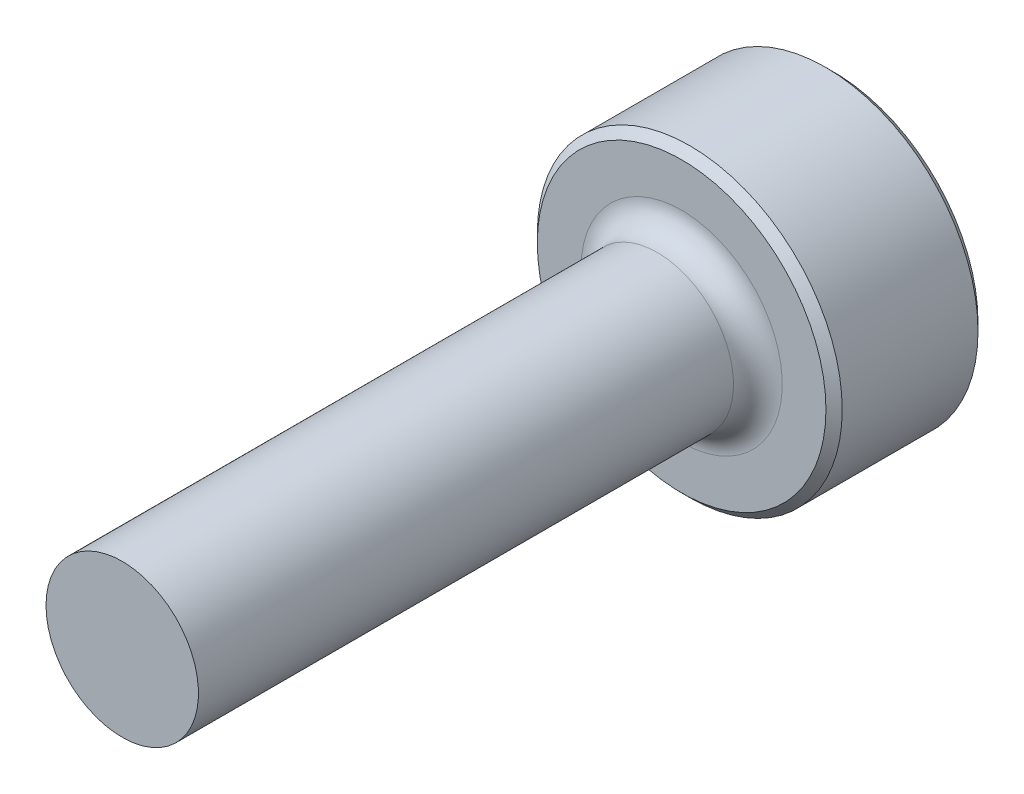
from build123d import *

# Parameters (mm, degrees)
CHAMFER1_SIZE = 0.254


with BuildPart() as part:
    # Sketch1 → Revolve1 (revolve)
    with BuildSketch(Plane(origin=(0, 0, 0), x_dir=(0, 0, -1), z_dir=(1, 0, 0)), mode=Mode.PRIVATE) as revolve1_sk:
        with BuildLine():
            Line((0, 0), (0, 4.7625))
            Line((0, 4.7625), (-4.7498, 4.7625))
            Line((-4.7498, 4.7625), (-4.7498, 3.14325))
            ThreePointArc((-4.7498, 3.14325), (-4.972984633, 2.604434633), (-5.5118, 2.38125))
            Line((-5.5118, 2.38125), (-22.225, 2.38125))
            Line((-22.225, 2.38125), (-22.225, 0))
            Line((-22.225, 0), (0, 0))
        make_face()
    revolve(revolve1_sk.sketch.rotate(Axis((0, 0, -25.434744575), (0, 0, 1)), 90), axis=Axis((0, 0, -25.434744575), (0, 0, 1)))

    # Chamfer1
    chamfer1_edges = [part.edges().sort_by_distance(p)[0] for p in [
        (4.7625, 0, 0),
        (4.7625, 0, 4.7498),
    ]]
    chamfer(chamfer1_edges, length=CHAMFER1_SIZE)


solid = part.part
